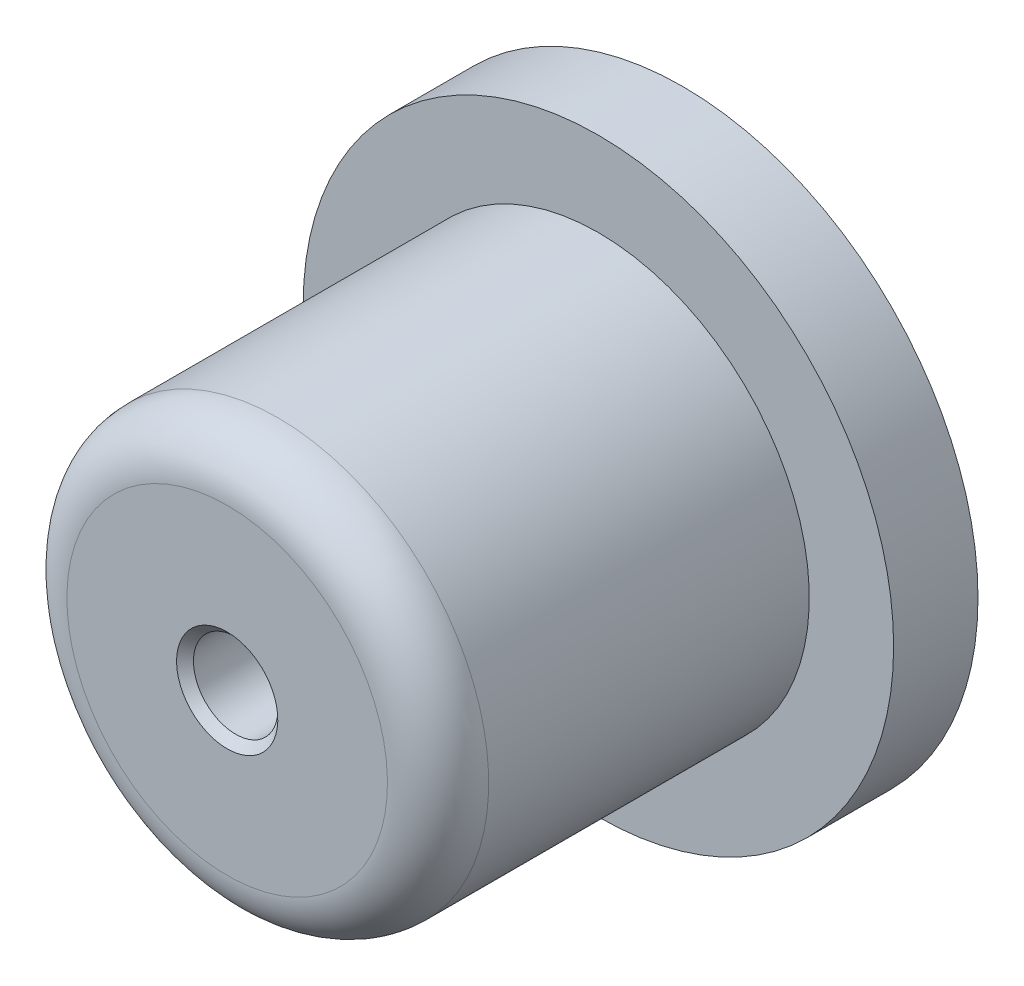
from build123d import *


with BuildPart() as part:
    # Sketch1 → Revolve1 (revolve)
    with BuildSketch(Plane(origin=(0, 0, 0), x_dir=(0, 0, -1), z_dir=(1, 0, 0))):
        with BuildLine():
            Line((0, 0), (0, 17.5))
            Line((0, 17.5), (-5, 17.5))
            Line((-5, 17.5), (-5, 12.5))
            Line((-5, 12.5), (-24, 12.5))
            ThreePointArc((-24, 12.5), (-26.121320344, 11.621320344), (-27, 9.5))
            Line((-27, 9.5), (-27, 3))
            Line((-27, 3), (-26.5, 2.5))
            Line((-26.5, 2.5), (-21, 2.5))
            Line((-21, 2.5), (-19.249481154, 0))
            Line((-19.249481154, 0), (0, 0))
        make_face()
    revolve(axis=Axis((0, 0, 0), (0, 0, 1)))


solid = part.part
